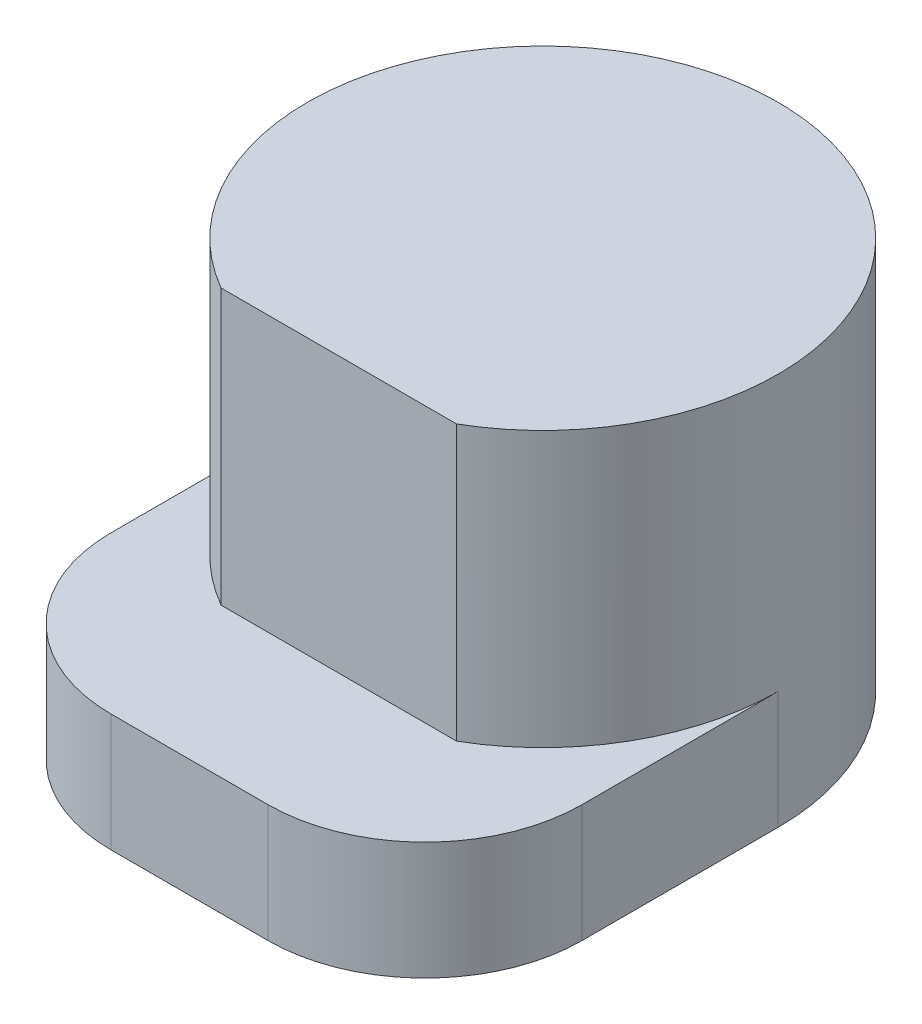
from build123d import *

# Parameters (mm, degrees)
EXTRUDE_1_DEPTH = 100
EXTRUDE_2_DEPTH = 30


with BuildPart() as part:
    # Sketch 1 → Extrude 1 (new body)
    with BuildSketch(Plane(origin=(0, 0, 0), x_dir=(1, 0, 0), z_dir=(0, 1, 0))):
        with BuildLine():
            Line((-30, -51.961524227), (30, -51.961524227))
            ThreePointArc((30, -51.961524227), (0, 60), (-30, -51.961524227))
        make_face()
    extrude(amount=EXTRUDE_1_DEPTH)

    # Sketch 1_3 → Extrude 2 (add)
    with BuildSketch(Plane(origin=(0, 0, 0), x_dir=(1, 0, 0), z_dir=(0, 1, 0))):
        with BuildLine():
            ThreePointArc((-30, -51.961524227), (-51.961524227, -30), (-60, 0))
            Line((-60, 0), (-60, -50))
            ThreePointArc((-60, -50), (-48.284271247, -78.284271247), (-20, -90))
            Line((-20, -90), (20, -90))
            ThreePointArc((20, -90), (48.284271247, -78.284271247), (60, -50))
            Line((60, -50), (60, 0))
            ThreePointArc((60, 0), (51.961524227, -30), (30, -51.961524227))
            Line((30, -51.961524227), (-30, -51.961524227))
        make_face()
    extrude(amount=EXTRUDE_2_DEPTH)


solid = part.part
